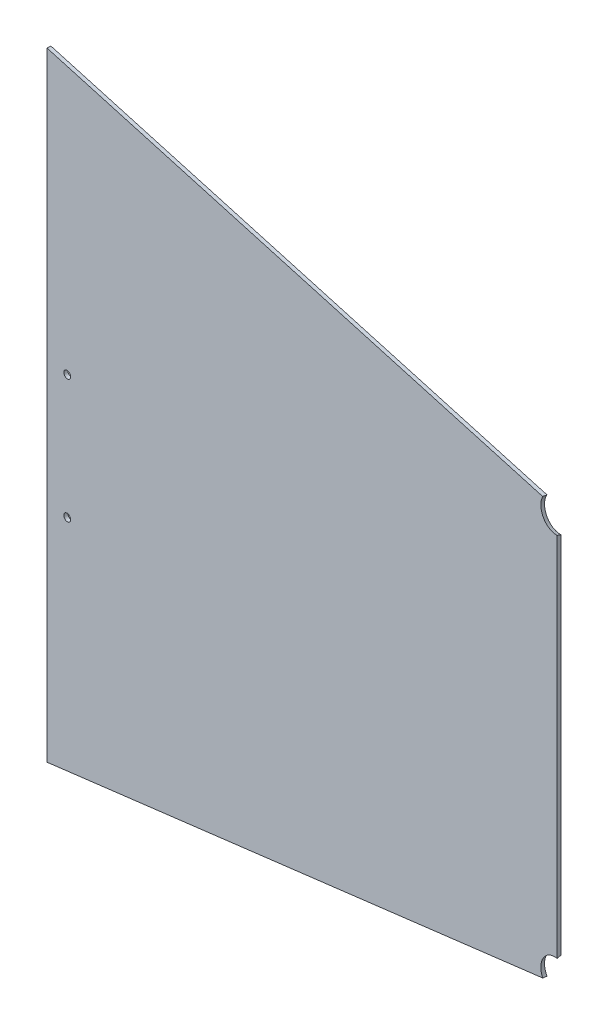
ISO-10303-21;
HEADER;
FILE_DESCRIPTION(('STEP AP214'),'2;1');
FILE_NAME('part.step','',(''),(''),'','','');
FILE_SCHEMA(('AUTOMOTIVE_DESIGN { 1 0 10303 214 1 1 1 1 }'));
ENDSEC;
DATA;
#1=APPLICATION_CONTEXT('core data for automotive mechanical design processes');
#2=APPLICATION_PROTOCOL_DEFINITION('international standard','automotive_design',2000,#1);
#3=PRODUCT_CONTEXT('',#1,'mechanical');
#4=PRODUCT('Part','Part','',(#3));
#5=PRODUCT_RELATED_PRODUCT_CATEGORY('part','',(#4));
#6=PRODUCT_DEFINITION_FORMATION('','',#4);
#7=PRODUCT_DEFINITION_CONTEXT('part definition',#1,'design');
#8=PRODUCT_DEFINITION('design','',#6,#7);
#9=PRODUCT_DEFINITION_SHAPE('','',#8);
#10=(LENGTH_UNIT() NAMED_UNIT(*) SI_UNIT(.MILLI.,.METRE.));
#11=(NAMED_UNIT(*) PLANE_ANGLE_UNIT() SI_UNIT($,.RADIAN.));
#12=(NAMED_UNIT(*) SI_UNIT($,.STERADIAN.) SOLID_ANGLE_UNIT());
#13=UNCERTAINTY_MEASURE_WITH_UNIT(LENGTH_MEASURE(1.E-05),#10,'distance_accuracy_value','');
#14=(GEOMETRIC_REPRESENTATION_CONTEXT(3) GLOBAL_UNCERTAINTY_ASSIGNED_CONTEXT((#13)) GLOBAL_UNIT_ASSIGNED_CONTEXT((#10,
#11,#12)) REPRESENTATION_CONTEXT('',''));
#15=CARTESIAN_POINT('',(0.,0.,0.));
#16=DIRECTION('',(0.,0.,1.));
#17=DIRECTION('',(1.,0.,0.));
#18=AXIS2_PLACEMENT_3D('',#15,#16,#17);
#19=CARTESIAN_POINT('',(185.325599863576,-298.45,-15.8314114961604));
#20=DIRECTION('',(-0.183879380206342,0.982853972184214,-0.0136544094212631));
#21=DIRECTION('',(-0.982945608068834,-0.183896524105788,0.));
#22=AXIS2_PLACEMENT_3D('',#19,#20,#21);
#23=PLANE('',#22);
#24=DIRECTION('',(-0.0740535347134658,0.,0.99725426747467));
#25=VECTOR('',#24,1.);
#26=CARTESIAN_POINT('',(353.489395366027,-267.476862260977,-50.9690009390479));
#27=LINE('',#26,#25);
#28=CARTESIAN_POINT('',(349.972279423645,-267.476862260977,-3.60517291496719));
#29=VERTEX_POINT('',#28);
#30=CARTESIAN_POINT('',(349.737159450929,-267.476862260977,-0.438890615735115));
#31=VERTEX_POINT('',#30);
#32=EDGE_CURVE('E61',#29,#31,#27,.T.);
#33=ORIENTED_EDGE('',*,*,#32,.F.);
#34=DIRECTION('',(-0.980155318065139,-0.184385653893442,-0.0727838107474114));
#35=VECTOR('',#34,1.);
#36=CARTESIAN_POINT('',(185.325599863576,-298.45,-15.8314114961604));
#37=LINE('',#36,#35);
#38=CARTESIAN_POINT('',(813.501935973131,-180.278213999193,30.8153461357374));
#39=VERTEX_POINT('',#38);
#40=EDGE_CURVE('E120',#39,#29,#37,.T.);
#41=ORIENTED_EDGE('',*,*,#40,.F.);
#42=CARTESIAN_POINT('',(825.5,-177.8,47.6250000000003));
#43=DIRECTION('',(-0.183879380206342,0.982853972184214,-0.0136544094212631));
#44=DIRECTION('',(-0.0641324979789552,0.00186562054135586,0.997939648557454));
#45=AXIS2_PLACEMENT_3D('',#42,#43,#44);
#46=ELLIPSE('',#45,43.3849012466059,14.2875);
#47=CARTESIAN_POINT('',(812.937098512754,-180.340240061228,33.9571444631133));
#48=VERTEX_POINT('',#47);
#49=EDGE_CURVE('E145',#48,#39,#46,.F.);
#50=ORIENTED_EDGE('',*,*,#49,.F.);
#51=DIRECTION('',(-0.980155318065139,-0.184385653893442,-0.0727838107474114));
#52=VECTOR('',#51,1.);
#53=CARTESIAN_POINT('',(185.090479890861,-298.45,-12.6651291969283));
#54=LINE('',#53,#52);
#55=EDGE_CURVE('E117',#48,#31,#54,.T.);
#56=ORIENTED_EDGE('',*,*,#55,.T.);
#57=EDGE_LOOP('',(#33,#41,#50,#56));
#58=FACE_BOUND('',#57,.T.);
#59=ADVANCED_FACE('F45',(#58),#23,.F.);
#60=CARTESIAN_POINT('',(826.675599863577,177.8,31.7935885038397));
#61=DIRECTION('',(-0.183879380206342,-0.982853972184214,-0.0136544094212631));
#62=DIRECTION('',(0.982945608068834,-0.183896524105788,0.));
#63=AXIS2_PLACEMENT_3D('',#60,#61,#62);
#64=PLANE('',#63);
#65=DIRECTION('',(-0.0740535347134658,0.,0.99725426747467));
#66=VECTOR('',#65,1.);
#67=CARTESIAN_POINT('',(353.489395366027,267.476862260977,-50.9690009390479));
#68=LINE('',#67,#66);
#69=CARTESIAN_POINT('',(349.972279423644,267.476862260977,-3.6051729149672));
#70=VERTEX_POINT('',#69);
#71=CARTESIAN_POINT('',(349.737159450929,267.476862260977,-0.43889061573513));
#72=VERTEX_POINT('',#71);
#73=EDGE_CURVE('E98',#70,#72,#68,.T.);
#74=ORIENTED_EDGE('',*,*,#73,.T.);
#75=DIRECTION('',(0.980155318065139,-0.184385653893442,0.0727838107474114));
#76=VECTOR('',#75,1.);
#77=CARTESIAN_POINT('',(826.440479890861,177.8,34.9598708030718));
#78=LINE('',#77,#76);
#79=CARTESIAN_POINT('',(812.937098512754,180.340240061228,33.9571444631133));
#80=VERTEX_POINT('',#79);
#81=EDGE_CURVE('E109',#72,#80,#78,.T.);
#82=ORIENTED_EDGE('',*,*,#81,.T.);
#83=CARTESIAN_POINT('',(825.5,177.8,47.6250000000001));
#84=DIRECTION('',(-0.183879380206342,-0.982853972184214,-0.0136544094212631));
#85=DIRECTION('',(-0.0641324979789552,-0.00186562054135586,0.997939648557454));
#86=AXIS2_PLACEMENT_3D('',#83,#84,#85);
#87=ELLIPSE('',#86,43.3849012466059,14.2875);
#88=CARTESIAN_POINT('',(813.501935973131,180.278213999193,30.8153461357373));
#89=VERTEX_POINT('',#88);
#90=EDGE_CURVE('E152',#80,#89,#87,.T.);
#91=ORIENTED_EDGE('',*,*,#90,.T.);
#92=DIRECTION('',(0.980155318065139,-0.184385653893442,0.0727838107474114));
#93=VECTOR('',#92,1.);
#94=CARTESIAN_POINT('',(826.675599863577,177.8,31.7935885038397));
#95=LINE('',#94,#93);
#96=EDGE_CURVE('E111',#70,#89,#95,.T.);
#97=ORIENTED_EDGE('',*,*,#96,.F.);
#98=EDGE_LOOP('',(#74,#82,#91,#97));
#99=FACE_BOUND('',#98,.T.);
#100=ADVANCED_FACE('F107',(#99),#64,.F.);
#101=CARTESIAN_POINT('',(2.18546483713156,0.,-29.4309264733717));
#102=DIRECTION('',(-0.0740535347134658,0.,0.99725426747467));
#103=DIRECTION('',(0.997254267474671,0.,0.0740535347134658));
#104=AXIS2_PLACEMENT_3D('',#101,#102,#103);
#105=PLANE('',#104);
#106=CARTESIAN_POINT('',(368.969973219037,33.,-2.19445307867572));
#107=DIRECTION('',(0.0740535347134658,0.,-0.997254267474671));
#108=DIRECTION('',(-0.997254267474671,0.,-0.0740535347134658));
#109=AXIS2_PLACEMENT_3D('',#106,#107,#108);
#110=CIRCLE('',#109,3.17499999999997);
#111=CARTESIAN_POINT('',(365.803690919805,33.,-2.42957305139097));
#112=VERTEX_POINT('',#111);
#113=EDGE_CURVE('E129',#112,#112,#110,.T.);
#114=ORIENTED_EDGE('',*,*,#113,.F.);
#115=EDGE_LOOP('',(#114));
#116=FACE_BOUND('',#115,.T.);
#117=CARTESIAN_POINT('',(368.969973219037,-74.,-2.19445307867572));
#118=DIRECTION('',(0.0740535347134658,0.,-0.997254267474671));
#119=DIRECTION('',(-0.997254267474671,0.,-0.0740535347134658));
#120=AXIS2_PLACEMENT_3D('',#117,#118,#119);
#121=CIRCLE('',#120,3.17499999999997);
#122=CARTESIAN_POINT('',(365.803690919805,-74.,-2.42957305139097));
#123=VERTEX_POINT('',#122);
#124=EDGE_CURVE('E134',#123,#123,#121,.T.);
#125=ORIENTED_EDGE('',*,*,#124,.F.);
#126=EDGE_LOOP('',(#125));
#127=FACE_BOUND('',#126,.T.);
#128=DIRECTION('',(0.,-1.,0.));
#129=VECTOR('',#128,1.);
#130=CARTESIAN_POINT('',(349.972279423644,0.,-3.60517291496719));
#131=LINE('',#130,#129);
#132=EDGE_CURVE('E141',#70,#29,#131,.T.);
#133=ORIENTED_EDGE('',*,*,#132,.F.);
#134=ORIENTED_EDGE('',*,*,#96,.T.);
#135=CARTESIAN_POINT('',(825.5,172.387473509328,31.7062914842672));
#136=DIRECTION('',(-0.0740535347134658,0.,0.99725426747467));
#137=DIRECTION('',(0.212224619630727,0.977093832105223,0.0157592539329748));
#138=AXIS2_PLACEMENT_3D('',#135,#136,#137);
#139=ELLIPSE('',#138,15.1323357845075,14.2875);
#140=CARTESIAN_POINT('',(826.675599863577,157.377540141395,31.7935885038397));
#141=VERTEX_POINT('',#140);
#142=EDGE_CURVE('E122',#89,#141,#139,.T.);
#143=ORIENTED_EDGE('',*,*,#142,.T.);
#144=DIRECTION('',(0.,-1.,0.));
#145=VECTOR('',#144,1.);
#146=CARTESIAN_POINT('',(826.675599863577,-177.8,31.7935885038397));
#147=LINE('',#146,#145);
#148=CARTESIAN_POINT('',(826.675599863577,-157.377540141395,31.7935885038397));
#149=VERTEX_POINT('',#148);
#150=EDGE_CURVE('E126',#141,#149,#147,.T.);
#151=ORIENTED_EDGE('',*,*,#150,.T.);
#152=CARTESIAN_POINT('',(825.5,-172.387473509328,31.7062914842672));
#153=DIRECTION('',(-0.0740535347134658,0.,0.99725426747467));
#154=DIRECTION('',(0.212224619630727,-0.977093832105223,0.0157592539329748));
#155=AXIS2_PLACEMENT_3D('',#152,#153,#154);
#156=ELLIPSE('',#155,15.1323357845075,14.2875);
#157=EDGE_CURVE('E147',#39,#149,#156,.F.);
#158=ORIENTED_EDGE('',*,*,#157,.F.);
#159=ORIENTED_EDGE('',*,*,#40,.T.);
#160=EDGE_LOOP('',(#133,#134,#143,#151,#158,#159));
#161=FACE_BOUND('',#160,.T.);
#162=ADVANCED_FACE('F162',(#116,#127,#161),#105,.F.);
#163=CARTESIAN_POINT('',(1.95034486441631,0.,-26.2646441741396));
#164=DIRECTION('',(-0.0740535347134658,0.,0.99725426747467));
#165=DIRECTION('',(0.997254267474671,0.,0.0740535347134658));
#166=AXIS2_PLACEMENT_3D('',#163,#164,#165);
#167=PLANE('',#166);
#168=CARTESIAN_POINT('',(368.734853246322,33.,0.971829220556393));
#169=DIRECTION('',(-0.0740535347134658,0.,0.99725426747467));
#170=DIRECTION('',(0.997254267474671,0.,0.0740535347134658));
#171=AXIS2_PLACEMENT_3D('',#168,#169,#170);
#172=CIRCLE('',#171,3.17499999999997);
#173=CARTESIAN_POINT('',(371.901135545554,33.,1.20694919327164));
#174=VERTEX_POINT('',#173);
#175=EDGE_CURVE('E48',#174,#174,#172,.T.);
#176=ORIENTED_EDGE('',*,*,#175,.F.);
#177=EDGE_LOOP('',(#176));
#178=FACE_BOUND('',#177,.T.);
#179=CARTESIAN_POINT('',(368.734853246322,-74.,0.971829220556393));
#180=DIRECTION('',(-0.0740535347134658,0.,0.99725426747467));
#181=DIRECTION('',(0.997254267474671,0.,0.0740535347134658));
#182=AXIS2_PLACEMENT_3D('',#179,#180,#181);
#183=CIRCLE('',#182,3.17499999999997);
#184=CARTESIAN_POINT('',(371.901135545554,-74.,1.20694919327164));
#185=VERTEX_POINT('',#184);
#186=EDGE_CURVE('E127',#185,#185,#183,.T.);
#187=ORIENTED_EDGE('',*,*,#186,.F.);
#188=EDGE_LOOP('',(#187));
#189=FACE_BOUND('',#188,.T.);
#190=ORIENTED_EDGE('',*,*,#81,.F.);
#191=DIRECTION('',(0.,-1.,0.));
#192=VECTOR('',#191,1.);
#193=CARTESIAN_POINT('',(349.737159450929,0.,-0.43889061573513));
#194=LINE('',#193,#192);
#195=EDGE_CURVE('E95',#72,#31,#194,.T.);
#196=ORIENTED_EDGE('',*,*,#195,.T.);
#197=ORIENTED_EDGE('',*,*,#55,.F.);
#198=CARTESIAN_POINT('',(825.5,-173.469978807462,34.8900331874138));
#199=DIRECTION('',(-0.0740535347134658,0.,0.99725426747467));
#200=DIRECTION('',(0.212224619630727,-0.977093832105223,0.0157592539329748));
#201=AXIS2_PLACEMENT_3D('',#198,#199,#200);
#202=ELLIPSE('',#201,15.1323357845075,14.2875);
#203=CARTESIAN_POINT('',(826.440479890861,-158.435667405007,34.9598708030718));
#204=VERTEX_POINT('',#203);
#205=EDGE_CURVE('E11',#48,#204,#202,.F.);
#206=ORIENTED_EDGE('',*,*,#205,.T.);
#207=DIRECTION('',(0.,-1.,0.));
#208=VECTOR('',#207,1.);
#209=CARTESIAN_POINT('',(826.440479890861,-177.8,34.9598708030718));
#210=LINE('',#209,#208);
#211=CARTESIAN_POINT('',(826.440479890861,158.435667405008,34.9598708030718));
#212=VERTEX_POINT('',#211);
#213=EDGE_CURVE('E116',#212,#204,#210,.T.);
#214=ORIENTED_EDGE('',*,*,#213,.F.);
#215=CARTESIAN_POINT('',(825.5,173.469978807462,34.8900331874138));
#216=DIRECTION('',(-0.0740535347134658,0.,0.99725426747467));
#217=DIRECTION('',(0.212224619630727,0.977093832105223,0.0157592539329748));
#218=AXIS2_PLACEMENT_3D('',#215,#216,#217);
#219=ELLIPSE('',#218,15.1323357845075,14.2875);
#220=EDGE_CURVE('E53',#80,#212,#219,.T.);
#221=ORIENTED_EDGE('',*,*,#220,.F.);
#222=EDGE_LOOP('',(#190,#196,#197,#206,#214,#221));
#223=FACE_BOUND('',#222,.T.);
#224=ADVANCED_FACE('F114',(#178,#189,#223),#167,.T.);
#225=CARTESIAN_POINT('',(826.675599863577,-177.8,31.7935885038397));
#226=DIRECTION('',(-0.99725426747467,0.,-0.0740535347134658));
#227=DIRECTION('',(-0.0740535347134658,0.,0.99725426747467));
#228=AXIS2_PLACEMENT_3D('',#225,#226,#227);
#229=PLANE('',#228);
#230=CARTESIAN_POINT('',(825.5,-177.800000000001,47.6250000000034));
#231=DIRECTION('',(-0.99725426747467,0.,-0.0740535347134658));
#232=DIRECTION('',(-0.0700916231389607,-0.322705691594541,0.943900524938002));
#233=AXIS2_PLACEMENT_3D('',#230,#231,#232);
#234=ELLIPSE('',#233,203.782121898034,14.2875);
#235=EDGE_CURVE('E69',#149,#204,#234,.F.);
#236=ORIENTED_EDGE('',*,*,#235,.F.);
#237=ORIENTED_EDGE('',*,*,#150,.F.);
#238=CARTESIAN_POINT('',(825.5,177.800000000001,47.6250000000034));
#239=DIRECTION('',(-0.99725426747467,0.,-0.0740535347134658));
#240=DIRECTION('',(-0.0700916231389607,0.322705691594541,0.943900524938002));
#241=AXIS2_PLACEMENT_3D('',#238,#239,#240);
#242=ELLIPSE('',#241,203.782121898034,14.2875);
#243=EDGE_CURVE('E149',#141,#212,#242,.T.);
#244=ORIENTED_EDGE('',*,*,#243,.T.);
#245=ORIENTED_EDGE('',*,*,#213,.T.);
#246=EDGE_LOOP('',(#236,#237,#244,#245));
#247=FACE_BOUND('',#246,.T.);
#248=ADVANCED_FACE('F166',(#247),#229,.F.);
#249=CARTESIAN_POINT('',(825.5,109.107616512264,-154.405240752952));
#250=DIRECTION('',(0.,0.32191156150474,0.946769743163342));
#251=DIRECTION('',(0.,-0.946769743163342,0.32191156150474));
#252=AXIS2_PLACEMENT_3D('',#249,#250,#251);
#253=CYLINDRICAL_SURFACE('',#252,14.2875);
#254=ORIENTED_EDGE('',*,*,#90,.F.);
#255=ORIENTED_EDGE('',*,*,#220,.T.);
#256=ORIENTED_EDGE('',*,*,#243,.F.);
#257=ORIENTED_EDGE('',*,*,#142,.F.);
#258=EDGE_LOOP('',(#254,#255,#256,#257));
#259=FACE_BOUND('',#258,.T.);
#260=ADVANCED_FACE('F171',(#259),#253,.F.);
#261=CARTESIAN_POINT('',(825.5,-109.107616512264,-154.405240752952));
#262=DIRECTION('',(0.,-0.32191156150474,0.946769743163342));
#263=DIRECTION('',(0.,-0.946769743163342,-0.32191156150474));
#264=AXIS2_PLACEMENT_3D('',#261,#262,#263);
#265=CYLINDRICAL_SURFACE('',#264,14.2875);
#266=ORIENTED_EDGE('',*,*,#157,.T.);
#267=ORIENTED_EDGE('',*,*,#235,.T.);
#268=ORIENTED_EDGE('',*,*,#205,.F.);
#269=ORIENTED_EDGE('',*,*,#49,.T.);
#270=EDGE_LOOP('',(#266,#267,#268,#269));
#271=FACE_BOUND('',#270,.T.);
#272=ADVANCED_FACE('F168',(#271),#265,.F.);
#273=CARTESIAN_POINT('',(353.489395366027,0.,-50.9690009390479));
#274=DIRECTION('',(-0.99725426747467,0.,-0.0740535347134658));
#275=DIRECTION('',(-0.0740535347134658,0.,0.99725426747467));
#276=AXIS2_PLACEMENT_3D('',#273,#274,#275);
#277=PLANE('',#276);
#278=ORIENTED_EDGE('',*,*,#132,.T.);
#279=ORIENTED_EDGE('',*,*,#32,.T.);
#280=ORIENTED_EDGE('',*,*,#195,.F.);
#281=ORIENTED_EDGE('',*,*,#73,.F.);
#282=EDGE_LOOP('',(#278,#279,#280,#281));
#283=FACE_BOUND('',#282,.T.);
#284=ADVANCED_FACE('F97',(#283),#277,.T.);
#285=CARTESIAN_POINT('',(366.120647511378,-74.,36.176466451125));
#286=DIRECTION('',(0.0740535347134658,0.,-0.99725426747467));
#287=DIRECTION('',(-0.99725426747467,0.,-0.0740535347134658));
#288=AXIS2_PLACEMENT_3D('',#285,#286,#287);
#289=CYLINDRICAL_SURFACE('',#288,3.17499999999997);
#290=ORIENTED_EDGE('',*,*,#186,.T.);
#291=EDGE_LOOP('',(#290));
#292=FACE_BOUND('',#291,.T.);
#293=ORIENTED_EDGE('',*,*,#124,.T.);
#294=EDGE_LOOP('',(#293));
#295=FACE_BOUND('',#294,.T.);
#296=ADVANCED_FACE('F201',(#292,#295),#289,.F.);
#297=CARTESIAN_POINT('',(366.120647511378,33.,36.176466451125));
#298=DIRECTION('',(0.0740535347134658,0.,-0.99725426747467));
#299=DIRECTION('',(-0.99725426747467,0.,-0.0740535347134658));
#300=AXIS2_PLACEMENT_3D('',#297,#298,#299);
#301=CYLINDRICAL_SURFACE('',#300,3.17499999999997);
#302=ORIENTED_EDGE('',*,*,#175,.T.);
#303=EDGE_LOOP('',(#302));
#304=FACE_BOUND('',#303,.T.);
#305=ORIENTED_EDGE('',*,*,#113,.T.);
#306=EDGE_LOOP('',(#305));
#307=FACE_BOUND('',#306,.T.);
#308=ADVANCED_FACE('F199',(#304,#307),#301,.F.);
#309=CLOSED_SHELL('',(#59,#100,#162,#224,#248,#260,#272,#284,#296,#308));
#310=MANIFOLD_SOLID_BREP('B2',#309);
#311=ADVANCED_BREP_SHAPE_REPRESENTATION('',(#18,#310),#14);
#312=SHAPE_DEFINITION_REPRESENTATION(#9,#311);
ENDSEC;
END-ISO-10303-21;
